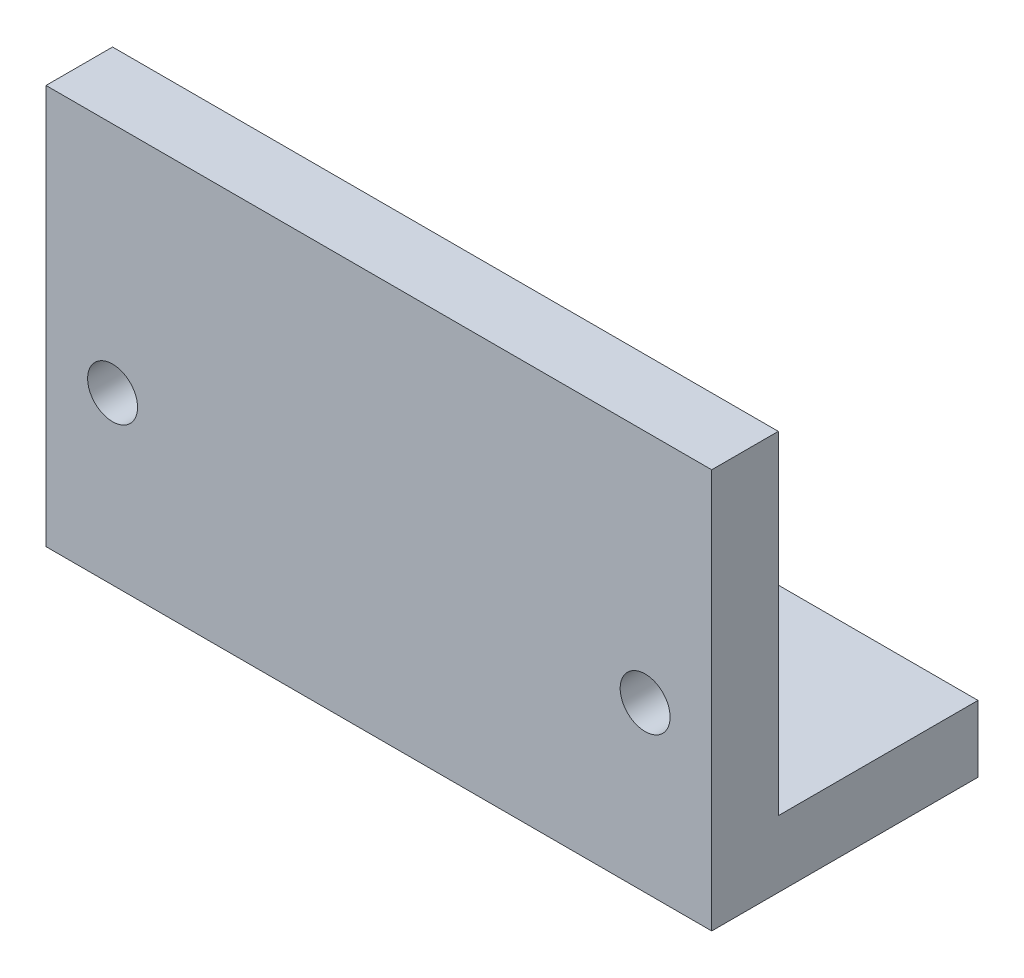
from build123d import *

# Parameters (mm, degrees)
SKETCH_1_W          = 200
SKETCH_1_H          = 120
EXTRUDE_1_DEPTH     = 20
SKETCH_2_W          = 200
SKETCH_2_H          = 20
EXTRUDE_2_DEPTH     = 60
SKETCH_3_R          = 7.5
CUT_EXTRUDE_3_DEPTH = 247.576560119
SKETCH_4_R          = 7.5
CUT_EXTRUDE_4_DEPTH = 247.576560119


with BuildPart() as part:
    # Sketch 1 → Extrude 1 (new body)
    with BuildSketch(Plane.XY):
        with Locations((100, 60)):
            Rectangle(SKETCH_1_W, SKETCH_1_H)
    extrude(amount=EXTRUDE_1_DEPTH)

    # Sketch 2 → Extrude 2 (add)
    with BuildSketch(Plane(origin=(0, 0, 0), x_dir=(-1, 0, 0), z_dir=(0, 0, -1))):
        with Locations((-100, 10)):
            Rectangle(SKETCH_2_W, SKETCH_2_H)
    extrude(amount=EXTRUDE_2_DEPTH)

    # Sketch 3 → Cut-Extrude 3 (cut, through all)
    with BuildSketch(Plane.XY.offset(20)):
        with Locations((20, 50)):
            Circle(SKETCH_3_R)
    extrude(amount=-CUT_EXTRUDE_3_DEPTH, mode=Mode.SUBTRACT)

    # Sketch 4 → Cut-Extrude 4 (cut, through all)
    with BuildSketch(Plane.XY.offset(20)):
        with Locations((180, 49.388074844)):
            Circle(SKETCH_4_R)
    extrude(amount=-CUT_EXTRUDE_4_DEPTH, mode=Mode.SUBTRACT)


solid = part.part
